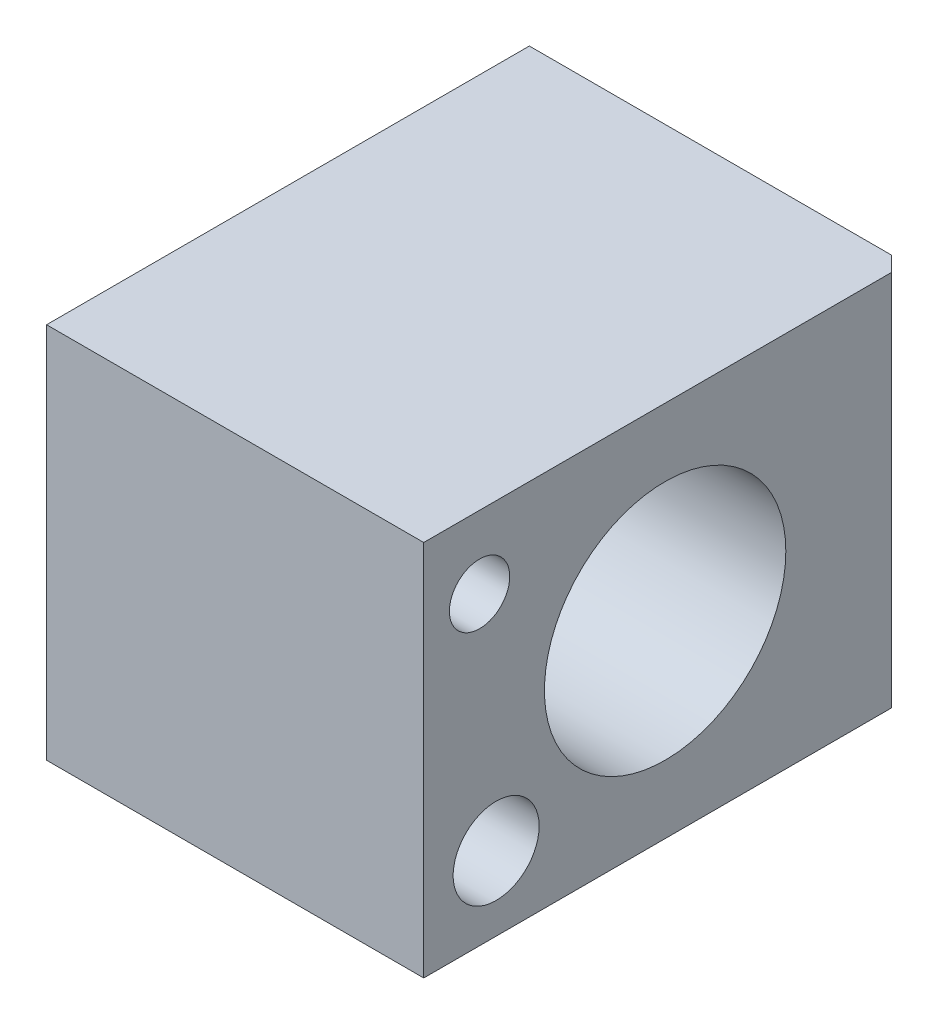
ISO-10303-21;
HEADER;
FILE_DESCRIPTION(('STEP AP214'),'2;1');
FILE_NAME('part.step','',(''),(''),'','','');
FILE_SCHEMA(('AUTOMOTIVE_DESIGN { 1 0 10303 214 1 1 1 1 }'));
ENDSEC;
DATA;
#1=APPLICATION_CONTEXT('core data for automotive mechanical design processes');
#2=APPLICATION_PROTOCOL_DEFINITION('international standard','automotive_design',2000,#1);
#3=PRODUCT_CONTEXT('',#1,'mechanical');
#4=PRODUCT('Part','Part','',(#3));
#5=PRODUCT_RELATED_PRODUCT_CATEGORY('part','',(#4));
#6=PRODUCT_DEFINITION_FORMATION('','',#4);
#7=PRODUCT_DEFINITION_CONTEXT('part definition',#1,'design');
#8=PRODUCT_DEFINITION('design','',#6,#7);
#9=PRODUCT_DEFINITION_SHAPE('','',#8);
#10=(LENGTH_UNIT() NAMED_UNIT(*) SI_UNIT(.MILLI.,.METRE.));
#11=(NAMED_UNIT(*) PLANE_ANGLE_UNIT() SI_UNIT($,.RADIAN.));
#12=(NAMED_UNIT(*) SI_UNIT($,.STERADIAN.) SOLID_ANGLE_UNIT());
#13=UNCERTAINTY_MEASURE_WITH_UNIT(LENGTH_MEASURE(1.E-05),#10,'distance_accuracy_value','');
#14=(GEOMETRIC_REPRESENTATION_CONTEXT(3) GLOBAL_UNCERTAINTY_ASSIGNED_CONTEXT((#13)) GLOBAL_UNIT_ASSIGNED_CONTEXT((#10,
#11,#12)) REPRESENTATION_CONTEXT('',''));
#15=CARTESIAN_POINT('',(0.,0.,0.));
#16=DIRECTION('',(0.,0.,1.));
#17=DIRECTION('',(1.,0.,0.));
#18=AXIS2_PLACEMENT_3D('',#15,#16,#17);
#19=CARTESIAN_POINT('',(12.5,12.5,16.));
#20=DIRECTION('',(0.,0.,-1.));
#21=DIRECTION('',(-1.,0.,0.));
#22=AXIS2_PLACEMENT_3D('',#19,#20,#21);
#23=PLANE('',#22);
#24=DIRECTION('',(0.,-1.,0.));
#25=VECTOR('',#24,1.);
#26=CARTESIAN_POINT('',(-12.5,12.5,16.));
#27=LINE('',#26,#25);
#28=CARTESIAN_POINT('',(-12.5,12.5,16.));
#29=VERTEX_POINT('',#28);
#30=CARTESIAN_POINT('',(-12.5,-12.5,16.));
#31=VERTEX_POINT('',#30);
#32=EDGE_CURVE('E100',#29,#31,#27,.T.);
#33=ORIENTED_EDGE('',*,*,#32,.T.);
#34=DIRECTION('',(-1.,0.,0.));
#35=VECTOR('',#34,1.);
#36=CARTESIAN_POINT('',(12.5,-12.5,16.));
#37=LINE('',#36,#35);
#38=CARTESIAN_POINT('',(12.5,-12.5,16.));
#39=VERTEX_POINT('',#38);
#40=EDGE_CURVE('E83',#39,#31,#37,.T.);
#41=ORIENTED_EDGE('',*,*,#40,.F.);
#42=DIRECTION('',(0.,-1.,0.));
#43=VECTOR('',#42,1.);
#44=CARTESIAN_POINT('',(12.5,12.5,16.));
#45=LINE('',#44,#43);
#46=CARTESIAN_POINT('',(12.5,12.5,16.));
#47=VERTEX_POINT('',#46);
#48=EDGE_CURVE('E90',#47,#39,#45,.T.);
#49=ORIENTED_EDGE('',*,*,#48,.F.);
#50=DIRECTION('',(-1.,0.,0.));
#51=VECTOR('',#50,1.);
#52=CARTESIAN_POINT('',(12.5,12.5,16.));
#53=LINE('',#52,#51);
#54=EDGE_CURVE('E110',#47,#29,#53,.T.);
#55=ORIENTED_EDGE('',*,*,#54,.T.);
#56=EDGE_LOOP('',(#33,#41,#49,#55));
#57=FACE_BOUND('',#56,.T.);
#58=ADVANCED_FACE('F33',(#57),#23,.F.);
#59=CARTESIAN_POINT('',(12.5,-12.5,16.));
#60=DIRECTION('',(0.,1.,0.));
#61=DIRECTION('',(0.,0.,1.));
#62=AXIS2_PLACEMENT_3D('',#59,#60,#61);
#63=PLANE('',#62);
#64=DIRECTION('',(-1.,0.,0.));
#65=VECTOR('',#64,1.);
#66=CARTESIAN_POINT('',(12.5,-12.5,-16.));
#67=LINE('',#66,#65);
#68=CARTESIAN_POINT('',(11.5,-12.5,-16.));
#69=VERTEX_POINT('',#68);
#70=CARTESIAN_POINT('',(-12.5,-12.5,-16.));
#71=VERTEX_POINT('',#70);
#72=EDGE_CURVE('E102',#69,#71,#67,.T.);
#73=ORIENTED_EDGE('',*,*,#72,.F.);
#74=DIRECTION('',(0.707106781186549,0.,0.707106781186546));
#75=VECTOR('',#74,1.);
#76=CARTESIAN_POINT('',(12.5,-12.5,-15.));
#77=LINE('',#76,#75);
#78=CARTESIAN_POINT('',(12.5,-12.5,-15.));
#79=VERTEX_POINT('',#78);
#80=EDGE_CURVE('E11',#69,#79,#77,.T.);
#81=ORIENTED_EDGE('',*,*,#80,.T.);
#82=DIRECTION('',(0.,0.,-1.));
#83=VECTOR('',#82,1.);
#84=CARTESIAN_POINT('',(12.5,-12.5,16.));
#85=LINE('',#84,#83);
#86=EDGE_CURVE('E78',#39,#79,#85,.T.);
#87=ORIENTED_EDGE('',*,*,#86,.F.);
#88=ORIENTED_EDGE('',*,*,#40,.T.);
#89=DIRECTION('',(0.,0.,-1.));
#90=VECTOR('',#89,1.);
#91=CARTESIAN_POINT('',(-12.5,-12.5,16.));
#92=LINE('',#91,#90);
#93=EDGE_CURVE('E116',#31,#71,#92,.T.);
#94=ORIENTED_EDGE('',*,*,#93,.T.);
#95=EDGE_LOOP('',(#73,#81,#87,#88,#94));
#96=FACE_BOUND('',#95,.T.);
#97=ADVANCED_FACE('F80',(#96),#63,.F.);
#98=CARTESIAN_POINT('',(12.5,12.5,-16.));
#99=DIRECTION('',(0.,0.,1.));
#100=DIRECTION('',(1.,0.,0.));
#101=AXIS2_PLACEMENT_3D('',#98,#99,#100);
#102=PLANE('',#101);
#103=DIRECTION('',(-1.,0.,0.));
#104=VECTOR('',#103,1.);
#105=CARTESIAN_POINT('',(12.5,12.5,-16.));
#106=LINE('',#105,#104);
#107=CARTESIAN_POINT('',(11.5,12.5,-16.));
#108=VERTEX_POINT('',#107);
#109=CARTESIAN_POINT('',(-12.5,12.5,-16.));
#110=VERTEX_POINT('',#109);
#111=EDGE_CURVE('E105',#108,#110,#106,.T.);
#112=ORIENTED_EDGE('',*,*,#111,.F.);
#113=DIRECTION('',(0.,-1.,0.));
#114=VECTOR('',#113,1.);
#115=CARTESIAN_POINT('',(11.5,-12.5,-16.));
#116=LINE('',#115,#114);
#117=EDGE_CURVE('E41',#108,#69,#116,.T.);
#118=ORIENTED_EDGE('',*,*,#117,.T.);
#119=ORIENTED_EDGE('',*,*,#72,.T.);
#120=DIRECTION('',(0.,1.,0.));
#121=VECTOR('',#120,1.);
#122=CARTESIAN_POINT('',(-12.5,12.5,-16.));
#123=LINE('',#122,#121);
#124=EDGE_CURVE('E113',#71,#110,#123,.T.);
#125=ORIENTED_EDGE('',*,*,#124,.T.);
#126=EDGE_LOOP('',(#112,#118,#119,#125));
#127=FACE_BOUND('',#126,.T.);
#128=ADVANCED_FACE('F165',(#127),#102,.F.);
#129=CARTESIAN_POINT('',(12.5,12.5,16.));
#130=DIRECTION('',(0.,-1.,0.));
#131=DIRECTION('',(0.,0.,-1.));
#132=AXIS2_PLACEMENT_3D('',#129,#130,#131);
#133=PLANE('',#132);
#134=DIRECTION('',(0.,0.,1.));
#135=VECTOR('',#134,1.);
#136=CARTESIAN_POINT('',(12.5,12.5,16.));
#137=LINE('',#136,#135);
#138=CARTESIAN_POINT('',(12.5,12.5,-15.));
#139=VERTEX_POINT('',#138);
#140=EDGE_CURVE('E89',#139,#47,#137,.T.);
#141=ORIENTED_EDGE('',*,*,#140,.F.);
#142=DIRECTION('',(-0.707106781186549,0.,-0.707106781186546));
#143=VECTOR('',#142,1.);
#144=CARTESIAN_POINT('',(12.5,12.5,-15.));
#145=LINE('',#144,#143);
#146=EDGE_CURVE('E55',#139,#108,#145,.T.);
#147=ORIENTED_EDGE('',*,*,#146,.T.);
#148=ORIENTED_EDGE('',*,*,#111,.T.);
#149=DIRECTION('',(0.,0.,1.));
#150=VECTOR('',#149,1.);
#151=CARTESIAN_POINT('',(-12.5,12.5,16.));
#152=LINE('',#151,#150);
#153=EDGE_CURVE('E97',#110,#29,#152,.T.);
#154=ORIENTED_EDGE('',*,*,#153,.T.);
#155=ORIENTED_EDGE('',*,*,#54,.F.);
#156=EDGE_LOOP('',(#141,#147,#148,#154,#155));
#157=FACE_BOUND('',#156,.T.);
#158=ADVANCED_FACE('F145',(#157),#133,.F.);
#159=CARTESIAN_POINT('',(12.5,-12.5,16.));
#160=DIRECTION('',(1.,0.,0.));
#161=DIRECTION('',(0.,0.,-1.));
#162=AXIS2_PLACEMENT_3D('',#159,#160,#161);
#163=PLANE('',#162);
#164=CARTESIAN_POINT('',(12.5,7.7,12.3));
#165=DIRECTION('',(1.,0.,0.));
#166=DIRECTION('',(0.,0.,-1.));
#167=AXIS2_PLACEMENT_3D('',#164,#165,#166);
#168=CIRCLE('',#167,2.);
#169=CARTESIAN_POINT('',(12.5,7.7,10.3));
#170=VERTEX_POINT('',#169);
#171=EDGE_CURVE('E135',#170,#170,#168,.T.);
#172=ORIENTED_EDGE('',*,*,#171,.F.);
#173=EDGE_LOOP('',(#172));
#174=FACE_BOUND('',#173,.T.);
#175=CARTESIAN_POINT('',(12.5,-7.6,11.2));
#176=DIRECTION('',(1.,0.,0.));
#177=DIRECTION('',(0.,0.,-1.));
#178=AXIS2_PLACEMENT_3D('',#175,#176,#177);
#179=CIRCLE('',#178,2.85);
#180=CARTESIAN_POINT('',(12.5,-7.6,8.35));
#181=VERTEX_POINT('',#180);
#182=EDGE_CURVE('E129',#181,#181,#179,.T.);
#183=ORIENTED_EDGE('',*,*,#182,.F.);
#184=EDGE_LOOP('',(#183));
#185=FACE_BOUND('',#184,.T.);
#186=CARTESIAN_POINT('',(12.5,0.,0.));
#187=DIRECTION('',(1.,0.,0.));
#188=DIRECTION('',(0.,0.,-1.));
#189=AXIS2_PLACEMENT_3D('',#186,#187,#188);
#190=CIRCLE('',#189,8.);
#191=CARTESIAN_POINT('',(12.5,0.,-8.));
#192=VERTEX_POINT('',#191);
#193=EDGE_CURVE('E123',#192,#192,#190,.T.);
#194=ORIENTED_EDGE('',*,*,#193,.F.);
#195=EDGE_LOOP('',(#194));
#196=FACE_BOUND('',#195,.T.);
#197=ORIENTED_EDGE('',*,*,#86,.T.);
#198=DIRECTION('',(0.,1.,0.));
#199=VECTOR('',#198,1.);
#200=CARTESIAN_POINT('',(12.5,12.5,-15.));
#201=LINE('',#200,#199);
#202=EDGE_CURVE('E101',#79,#139,#201,.T.);
#203=ORIENTED_EDGE('',*,*,#202,.T.);
#204=ORIENTED_EDGE('',*,*,#140,.T.);
#205=ORIENTED_EDGE('',*,*,#48,.T.);
#206=EDGE_LOOP('',(#197,#203,#204,#205));
#207=FACE_BOUND('',#206,.T.);
#208=ADVANCED_FACE('F93',(#174,#185,#196,#207),#163,.T.);
#209=CARTESIAN_POINT('',(-12.5,-12.5,16.));
#210=DIRECTION('',(1.,0.,0.));
#211=DIRECTION('',(0.,0.,-1.));
#212=AXIS2_PLACEMENT_3D('',#209,#210,#211);
#213=PLANE('',#212);
#214=CARTESIAN_POINT('',(-12.5,7.7,12.3));
#215=DIRECTION('',(1.,0.,0.));
#216=DIRECTION('',(0.,0.,-1.));
#217=AXIS2_PLACEMENT_3D('',#214,#215,#216);
#218=CIRCLE('',#217,2.);
#219=CARTESIAN_POINT('',(-12.5,7.7,10.3));
#220=VERTEX_POINT('',#219);
#221=EDGE_CURVE('E132',#220,#220,#218,.F.);
#222=ORIENTED_EDGE('',*,*,#221,.F.);
#223=EDGE_LOOP('',(#222));
#224=FACE_BOUND('',#223,.T.);
#225=CARTESIAN_POINT('',(-12.5,-7.6,11.2));
#226=DIRECTION('',(1.,0.,0.));
#227=DIRECTION('',(0.,0.,-1.));
#228=AXIS2_PLACEMENT_3D('',#225,#226,#227);
#229=CIRCLE('',#228,2.85);
#230=CARTESIAN_POINT('',(-12.5,-7.6,8.35));
#231=VERTEX_POINT('',#230);
#232=EDGE_CURVE('E126',#231,#231,#229,.F.);
#233=ORIENTED_EDGE('',*,*,#232,.F.);
#234=EDGE_LOOP('',(#233));
#235=FACE_BOUND('',#234,.T.);
#236=CARTESIAN_POINT('',(-12.5,0.,0.));
#237=DIRECTION('',(1.,0.,0.));
#238=DIRECTION('',(0.,0.,-1.));
#239=AXIS2_PLACEMENT_3D('',#236,#237,#238);
#240=CIRCLE('',#239,8.);
#241=CARTESIAN_POINT('',(-12.5,0.,-8.));
#242=VERTEX_POINT('',#241);
#243=EDGE_CURVE('E119',#242,#242,#240,.F.);
#244=ORIENTED_EDGE('',*,*,#243,.F.);
#245=EDGE_LOOP('',(#244));
#246=FACE_BOUND('',#245,.T.);
#247=ORIENTED_EDGE('',*,*,#32,.F.);
#248=ORIENTED_EDGE('',*,*,#153,.F.);
#249=ORIENTED_EDGE('',*,*,#124,.F.);
#250=ORIENTED_EDGE('',*,*,#93,.F.);
#251=EDGE_LOOP('',(#247,#248,#249,#250));
#252=FACE_BOUND('',#251,.T.);
#253=ADVANCED_FACE('F144',(#224,#235,#246,#252),#213,.F.);
#254=CARTESIAN_POINT('',(-12.501,0.,0.));
#255=DIRECTION('',(1.,0.,0.));
#256=DIRECTION('',(0.,0.,-1.));
#257=AXIS2_PLACEMENT_3D('',#254,#255,#256);
#258=CYLINDRICAL_SURFACE('',#257,8.);
#259=ORIENTED_EDGE('',*,*,#193,.T.);
#260=EDGE_LOOP('',(#259));
#261=FACE_BOUND('',#260,.T.);
#262=ORIENTED_EDGE('',*,*,#243,.T.);
#263=EDGE_LOOP('',(#262));
#264=FACE_BOUND('',#263,.T.);
#265=ADVANCED_FACE('F151',(#261,#264),#258,.F.);
#266=CARTESIAN_POINT('',(-12.501,-7.6,11.2));
#267=DIRECTION('',(1.,0.,0.));
#268=DIRECTION('',(0.,0.,-1.));
#269=AXIS2_PLACEMENT_3D('',#266,#267,#268);
#270=CYLINDRICAL_SURFACE('',#269,2.85);
#271=ORIENTED_EDGE('',*,*,#182,.T.);
#272=EDGE_LOOP('',(#271));
#273=FACE_BOUND('',#272,.T.);
#274=ORIENTED_EDGE('',*,*,#232,.T.);
#275=EDGE_LOOP('',(#274));
#276=FACE_BOUND('',#275,.T.);
#277=ADVANCED_FACE('F154',(#273,#276),#270,.F.);
#278=CARTESIAN_POINT('',(-12.501,7.7,12.3));
#279=DIRECTION('',(1.,0.,0.));
#280=DIRECTION('',(0.,0.,-1.));
#281=AXIS2_PLACEMENT_3D('',#278,#279,#280);
#282=CYLINDRICAL_SURFACE('',#281,2.);
#283=ORIENTED_EDGE('',*,*,#171,.T.);
#284=EDGE_LOOP('',(#283));
#285=FACE_BOUND('',#284,.T.);
#286=ORIENTED_EDGE('',*,*,#221,.T.);
#287=EDGE_LOOP('',(#286));
#288=FACE_BOUND('',#287,.T.);
#289=ADVANCED_FACE('F139',(#285,#288),#282,.F.);
#290=CARTESIAN_POINT('',(12.5,-12.5,-15.));
#291=DIRECTION('',(0.707106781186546,0.,-0.707106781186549));
#292=DIRECTION('',(-0.707106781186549,0.,-0.707106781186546));
#293=AXIS2_PLACEMENT_3D('',#290,#291,#292);
#294=PLANE('',#293);
#295=ORIENTED_EDGE('',*,*,#80,.F.);
#296=ORIENTED_EDGE('',*,*,#117,.F.);
#297=ORIENTED_EDGE('',*,*,#146,.F.);
#298=ORIENTED_EDGE('',*,*,#202,.F.);
#299=EDGE_LOOP('',(#295,#296,#297,#298));
#300=FACE_BOUND('',#299,.T.);
#301=ADVANCED_FACE('F35',(#300),#294,.T.);
#302=CLOSED_SHELL('',(#58,#97,#128,#158,#208,#253,#265,#277,#289,#301));
#303=MANIFOLD_SOLID_BREP('B2',#302);
#304=ADVANCED_BREP_SHAPE_REPRESENTATION('',(#18,#303),#14);
#305=SHAPE_DEFINITION_REPRESENTATION(#9,#304);
ENDSEC;
END-ISO-10303-21;
